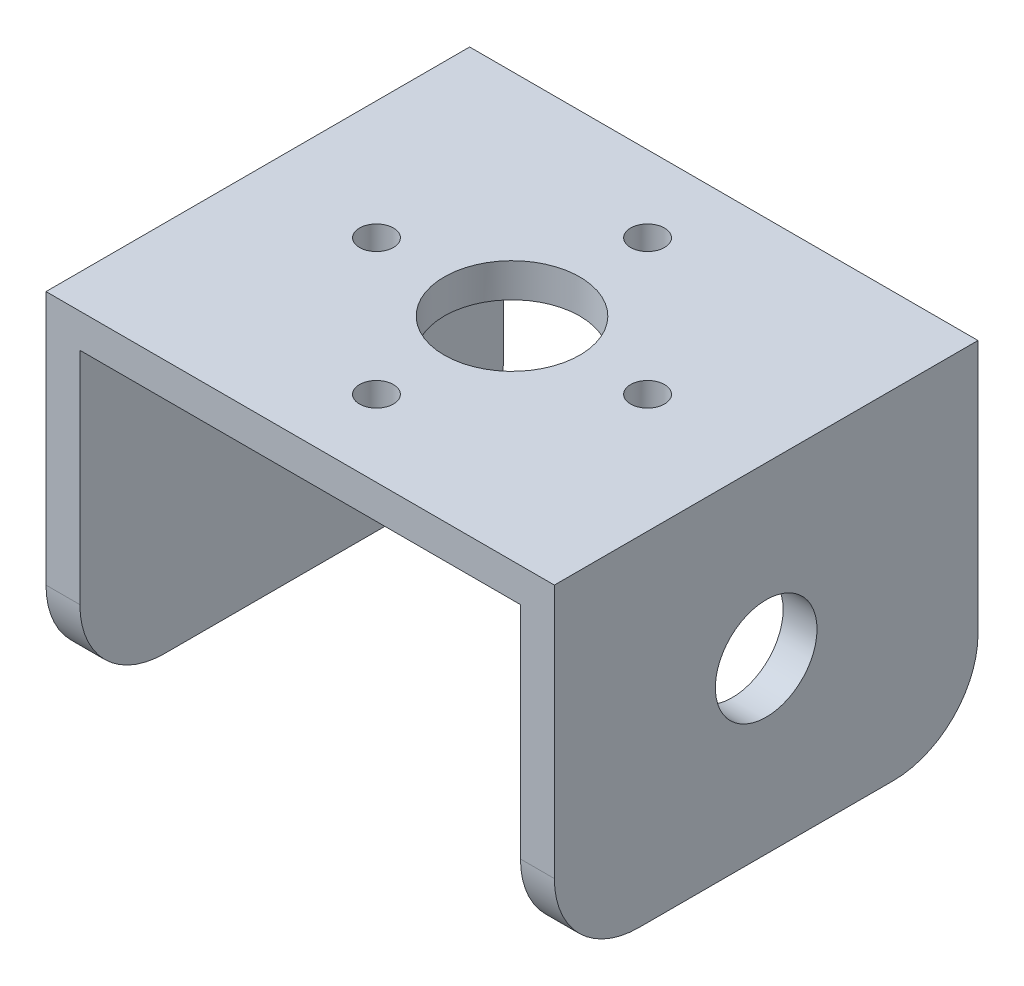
ISO-10303-21;
HEADER;
FILE_DESCRIPTION(('STEP AP214'),'2;1');
FILE_NAME('part.step','',(''),(''),'','','');
FILE_SCHEMA(('AUTOMOTIVE_DESIGN { 1 0 10303 214 1 1 1 1 }'));
ENDSEC;
DATA;
#1=APPLICATION_CONTEXT('core data for automotive mechanical design processes');
#2=APPLICATION_PROTOCOL_DEFINITION('international standard','automotive_design',2000,#1);
#3=PRODUCT_CONTEXT('',#1,'mechanical');
#4=PRODUCT('Part','Part','',(#3));
#5=PRODUCT_RELATED_PRODUCT_CATEGORY('part','',(#4));
#6=PRODUCT_DEFINITION_FORMATION('','',#4);
#7=PRODUCT_DEFINITION_CONTEXT('part definition',#1,'design');
#8=PRODUCT_DEFINITION('design','',#6,#7);
#9=PRODUCT_DEFINITION_SHAPE('','',#8);
#10=(LENGTH_UNIT() NAMED_UNIT(*) SI_UNIT(.MILLI.,.METRE.));
#11=(NAMED_UNIT(*) PLANE_ANGLE_UNIT() SI_UNIT($,.RADIAN.));
#12=(NAMED_UNIT(*) SI_UNIT($,.STERADIAN.) SOLID_ANGLE_UNIT());
#13=UNCERTAINTY_MEASURE_WITH_UNIT(LENGTH_MEASURE(1.E-05),#10,'distance_accuracy_value','');
#14=(GEOMETRIC_REPRESENTATION_CONTEXT(3) GLOBAL_UNCERTAINTY_ASSIGNED_CONTEXT((#13)) GLOBAL_UNIT_ASSIGNED_CONTEXT((#10,
#11,#12)) REPRESENTATION_CONTEXT('',''));
#15=CARTESIAN_POINT('',(0.,0.,0.));
#16=DIRECTION('',(0.,0.,1.));
#17=DIRECTION('',(1.,0.,0.));
#18=AXIS2_PLACEMENT_3D('',#15,#16,#17);
#19=CARTESIAN_POINT('',(-15.,-20.,12.5));
#20=DIRECTION('',(0.,0.,1.));
#21=DIRECTION('',(1.,0.,0.));
#22=AXIS2_PLACEMENT_3D('',#19,#20,#21);
#23=PLANE('',#22);
#24=DIRECTION('',(0.,1.,0.));
#25=VECTOR('',#24,1.);
#26=CARTESIAN_POINT('',(-15.,-20.,12.5));
#27=LINE('',#26,#25);
#28=CARTESIAN_POINT('',(-15.,-15.,12.5));
#29=VERTEX_POINT('',#28);
#30=CARTESIAN_POINT('',(-15.,0.,12.5));
#31=VERTEX_POINT('',#30);
#32=EDGE_CURVE('E194',#29,#31,#27,.T.);
#33=ORIENTED_EDGE('',*,*,#32,.F.);
#34=DIRECTION('',(1.,0.,0.));
#35=VECTOR('',#34,1.);
#36=CARTESIAN_POINT('',(-15.,-15.,12.5));
#37=LINE('',#36,#35);
#38=CARTESIAN_POINT('',(-13.,-15.,12.5));
#39=VERTEX_POINT('',#38);
#40=EDGE_CURVE('E11',#29,#39,#37,.T.);
#41=ORIENTED_EDGE('',*,*,#40,.T.);
#42=DIRECTION('',(0.,1.,0.));
#43=VECTOR('',#42,1.);
#44=CARTESIAN_POINT('',(-13.,-20.,12.5));
#45=LINE('',#44,#43);
#46=CARTESIAN_POINT('',(-13.,-2.,12.5));
#47=VERTEX_POINT('',#46);
#48=EDGE_CURVE('E144',#39,#47,#45,.T.);
#49=ORIENTED_EDGE('',*,*,#48,.T.);
#50=DIRECTION('',(1.,0.,0.));
#51=VECTOR('',#50,1.);
#52=CARTESIAN_POINT('',(-15.,-2.,12.5));
#53=LINE('',#52,#51);
#54=CARTESIAN_POINT('',(13.,-2.,12.5));
#55=VERTEX_POINT('',#54);
#56=EDGE_CURVE('E151',#47,#55,#53,.T.);
#57=ORIENTED_EDGE('',*,*,#56,.T.);
#58=DIRECTION('',(0.,1.,0.));
#59=VECTOR('',#58,1.);
#60=CARTESIAN_POINT('',(13.,-20.,12.5));
#61=LINE('',#60,#59);
#62=CARTESIAN_POINT('',(13.,-15.,12.5));
#63=VERTEX_POINT('',#62);
#64=EDGE_CURVE('E133',#63,#55,#61,.T.);
#65=ORIENTED_EDGE('',*,*,#64,.F.);
#66=DIRECTION('',(1.,0.,0.));
#67=VECTOR('',#66,1.);
#68=CARTESIAN_POINT('',(-15.,-15.,12.5));
#69=LINE('',#68,#67);
#70=CARTESIAN_POINT('',(15.,-15.,12.5));
#71=VERTEX_POINT('',#70);
#72=EDGE_CURVE('E49',#63,#71,#69,.T.);
#73=ORIENTED_EDGE('',*,*,#72,.T.);
#74=DIRECTION('',(0.,1.,0.));
#75=VECTOR('',#74,1.);
#76=CARTESIAN_POINT('',(15.,-20.,12.5));
#77=LINE('',#76,#75);
#78=CARTESIAN_POINT('',(15.,0.,12.5));
#79=VERTEX_POINT('',#78);
#80=EDGE_CURVE('E191',#71,#79,#77,.T.);
#81=ORIENTED_EDGE('',*,*,#80,.T.);
#82=DIRECTION('',(1.,0.,0.));
#83=VECTOR('',#82,1.);
#84=CARTESIAN_POINT('',(-15.,0.,12.5));
#85=LINE('',#84,#83);
#86=EDGE_CURVE('E177',#31,#79,#85,.T.);
#87=ORIENTED_EDGE('',*,*,#86,.F.);
#88=EDGE_LOOP('',(#33,#41,#49,#57,#65,#73,#81,#87));
#89=FACE_BOUND('',#88,.T.);
#90=ADVANCED_FACE('F41',(#89),#23,.T.);
#91=CARTESIAN_POINT('',(-15.,-20.,-12.5));
#92=DIRECTION('',(0.,0.,-1.));
#93=DIRECTION('',(-1.,0.,0.));
#94=AXIS2_PLACEMENT_3D('',#91,#92,#93);
#95=PLANE('',#94);
#96=DIRECTION('',(0.,1.,0.));
#97=VECTOR('',#96,1.);
#98=CARTESIAN_POINT('',(-13.,-20.,-12.5));
#99=LINE('',#98,#97);
#100=CARTESIAN_POINT('',(-13.,-15.,-12.5));
#101=VERTEX_POINT('',#100);
#102=CARTESIAN_POINT('',(-13.,-2.,-12.5));
#103=VERTEX_POINT('',#102);
#104=EDGE_CURVE('E167',#101,#103,#99,.T.);
#105=ORIENTED_EDGE('',*,*,#104,.F.);
#106=DIRECTION('',(-1.,0.,0.));
#107=VECTOR('',#106,1.);
#108=CARTESIAN_POINT('',(-15.,-15.,-12.5));
#109=LINE('',#108,#107);
#110=CARTESIAN_POINT('',(-15.,-15.,-12.5));
#111=VERTEX_POINT('',#110);
#112=EDGE_CURVE('E206',#101,#111,#109,.T.);
#113=ORIENTED_EDGE('',*,*,#112,.T.);
#114=DIRECTION('',(0.,1.,0.));
#115=VECTOR('',#114,1.);
#116=CARTESIAN_POINT('',(-15.,-20.,-12.5));
#117=LINE('',#116,#115);
#118=CARTESIAN_POINT('',(-15.,0.,-12.5));
#119=VERTEX_POINT('',#118);
#120=EDGE_CURVE('E196',#111,#119,#117,.T.);
#121=ORIENTED_EDGE('',*,*,#120,.T.);
#122=DIRECTION('',(-1.,0.,0.));
#123=VECTOR('',#122,1.);
#124=CARTESIAN_POINT('',(-15.,0.,-12.5));
#125=LINE('',#124,#123);
#126=CARTESIAN_POINT('',(15.,0.,-12.5));
#127=VERTEX_POINT('',#126);
#128=EDGE_CURVE('E183',#127,#119,#125,.T.);
#129=ORIENTED_EDGE('',*,*,#128,.F.);
#130=DIRECTION('',(0.,1.,0.));
#131=VECTOR('',#130,1.);
#132=CARTESIAN_POINT('',(15.,-20.,-12.5));
#133=LINE('',#132,#131);
#134=CARTESIAN_POINT('',(15.,-15.,-12.5));
#135=VERTEX_POINT('',#134);
#136=EDGE_CURVE('E180',#135,#127,#133,.T.);
#137=ORIENTED_EDGE('',*,*,#136,.F.);
#138=DIRECTION('',(-1.,0.,0.));
#139=VECTOR('',#138,1.);
#140=CARTESIAN_POINT('',(-15.,-15.,-12.5));
#141=LINE('',#140,#139);
#142=CARTESIAN_POINT('',(13.,-15.,-12.5));
#143=VERTEX_POINT('',#142);
#144=EDGE_CURVE('E193',#135,#143,#141,.T.);
#145=ORIENTED_EDGE('',*,*,#144,.T.);
#146=DIRECTION('',(0.,1.,0.));
#147=VECTOR('',#146,1.);
#148=CARTESIAN_POINT('',(13.,-20.,-12.5));
#149=LINE('',#148,#147);
#150=CARTESIAN_POINT('',(13.,-2.,-12.5));
#151=VERTEX_POINT('',#150);
#152=EDGE_CURVE('E170',#143,#151,#149,.T.);
#153=ORIENTED_EDGE('',*,*,#152,.T.);
#154=DIRECTION('',(-1.,0.,0.));
#155=VECTOR('',#154,1.);
#156=CARTESIAN_POINT('',(-15.,-2.,-12.5));
#157=LINE('',#156,#155);
#158=EDGE_CURVE('E153',#151,#103,#157,.T.);
#159=ORIENTED_EDGE('',*,*,#158,.T.);
#160=EDGE_LOOP('',(#105,#113,#121,#129,#137,#145,#153,#159));
#161=FACE_BOUND('',#160,.T.);
#162=ADVANCED_FACE('F258',(#161),#95,.T.);
#163=CARTESIAN_POINT('',(0.,-20.,0.));
#164=DIRECTION('',(0.,-1.,0.));
#165=DIRECTION('',(0.,0.,-1.));
#166=AXIS2_PLACEMENT_3D('',#163,#164,#165);
#167=PLANE('',#166);
#168=DIRECTION('',(0.,0.,-1.));
#169=VECTOR('',#168,1.);
#170=CARTESIAN_POINT('',(13.,-20.,12.5));
#171=LINE('',#170,#169);
#172=CARTESIAN_POINT('',(13.,-20.,7.5));
#173=VERTEX_POINT('',#172);
#174=CARTESIAN_POINT('',(13.,-20.,-7.5));
#175=VERTEX_POINT('',#174);
#176=EDGE_CURVE('E159',#173,#175,#171,.T.);
#177=ORIENTED_EDGE('',*,*,#176,.T.);
#178=DIRECTION('',(-1.,0.,0.));
#179=VECTOR('',#178,1.);
#180=CARTESIAN_POINT('',(0.,-20.,-7.5));
#181=LINE('',#180,#179);
#182=CARTESIAN_POINT('',(15.,-20.,-7.5));
#183=VERTEX_POINT('',#182);
#184=EDGE_CURVE('E64',#175,#183,#181,.F.);
#185=ORIENTED_EDGE('',*,*,#184,.T.);
#186=DIRECTION('',(0.,0.,-1.));
#187=VECTOR('',#186,1.);
#188=CARTESIAN_POINT('',(15.,-20.,12.5));
#189=LINE('',#188,#187);
#190=CARTESIAN_POINT('',(15.,-20.,7.5));
#191=VERTEX_POINT('',#190);
#192=EDGE_CURVE('E174',#191,#183,#189,.T.);
#193=ORIENTED_EDGE('',*,*,#192,.F.);
#194=DIRECTION('',(1.,0.,0.));
#195=VECTOR('',#194,1.);
#196=CARTESIAN_POINT('',(0.,-20.,7.5));
#197=LINE('',#196,#195);
#198=EDGE_CURVE('E224',#191,#173,#197,.F.);
#199=ORIENTED_EDGE('',*,*,#198,.T.);
#200=EDGE_LOOP('',(#177,#185,#193,#199));
#201=FACE_BOUND('',#200,.T.);
#202=ADVANCED_FACE('F262',(#201),#167,.T.);
#203=DIRECTION('',(0.,0.,1.));
#204=VECTOR('',#203,1.);
#205=CARTESIAN_POINT('',(-15.,-20.,12.5));
#206=LINE('',#205,#204);
#207=CARTESIAN_POINT('',(-15.,-20.,-7.5));
#208=VERTEX_POINT('',#207);
#209=CARTESIAN_POINT('',(-15.,-20.,7.5));
#210=VERTEX_POINT('',#209);
#211=EDGE_CURVE('E176',#208,#210,#206,.T.);
#212=ORIENTED_EDGE('',*,*,#211,.F.);
#213=DIRECTION('',(-1.,0.,0.));
#214=VECTOR('',#213,1.);
#215=CARTESIAN_POINT('',(0.,-20.,-7.5));
#216=LINE('',#215,#214);
#217=CARTESIAN_POINT('',(-13.,-20.,-7.5));
#218=VERTEX_POINT('',#217);
#219=EDGE_CURVE('E215',#208,#218,#216,.F.);
#220=ORIENTED_EDGE('',*,*,#219,.T.);
#221=DIRECTION('',(0.,0.,1.));
#222=VECTOR('',#221,1.);
#223=CARTESIAN_POINT('',(-13.,-20.,12.5));
#224=LINE('',#223,#222);
#225=CARTESIAN_POINT('',(-13.,-20.,7.5));
#226=VERTEX_POINT('',#225);
#227=EDGE_CURVE('E162',#218,#226,#224,.T.);
#228=ORIENTED_EDGE('',*,*,#227,.T.);
#229=DIRECTION('',(1.,0.,0.));
#230=VECTOR('',#229,1.);
#231=CARTESIAN_POINT('',(0.,-20.,7.5));
#232=LINE('',#231,#230);
#233=EDGE_CURVE('E213',#226,#210,#232,.F.);
#234=ORIENTED_EDGE('',*,*,#233,.T.);
#235=EDGE_LOOP('',(#212,#220,#228,#234));
#236=FACE_BOUND('',#235,.T.);
#237=ADVANCED_FACE('F251',(#236),#167,.T.);
#238=CARTESIAN_POINT('',(15.,-20.,12.5));
#239=DIRECTION('',(1.,0.,0.));
#240=DIRECTION('',(0.,0.,-1.));
#241=AXIS2_PLACEMENT_3D('',#238,#239,#240);
#242=PLANE('',#241);
#243=CARTESIAN_POINT('',(15.,-10.,0.));
#244=DIRECTION('',(1.,0.,0.));
#245=DIRECTION('',(0.,0.,-1.));
#246=AXIS2_PLACEMENT_3D('',#243,#244,#245);
#247=CIRCLE('',#246,3.);
#248=CARTESIAN_POINT('',(15.,-10.,-3.));
#249=VERTEX_POINT('',#248);
#250=EDGE_CURVE('E329',#249,#249,#247,.T.);
#251=ORIENTED_EDGE('',*,*,#250,.F.);
#252=EDGE_LOOP('',(#251));
#253=FACE_BOUND('',#252,.T.);
#254=ORIENTED_EDGE('',*,*,#192,.T.);
#255=CARTESIAN_POINT('',(15.,-15.,-7.5));
#256=DIRECTION('',(1.,0.,0.));
#257=DIRECTION('',(0.,0.,-1.));
#258=AXIS2_PLACEMENT_3D('',#255,#256,#257);
#259=CIRCLE('',#258,5.);
#260=EDGE_CURVE('E228',#183,#135,#259,.T.);
#261=ORIENTED_EDGE('',*,*,#260,.T.);
#262=ORIENTED_EDGE('',*,*,#136,.T.);
#263=DIRECTION('',(0.,0.,-1.));
#264=VECTOR('',#263,1.);
#265=CARTESIAN_POINT('',(15.,0.,12.5));
#266=LINE('',#265,#264);
#267=EDGE_CURVE('E143',#79,#127,#266,.T.);
#268=ORIENTED_EDGE('',*,*,#267,.F.);
#269=ORIENTED_EDGE('',*,*,#80,.F.);
#270=CARTESIAN_POINT('',(15.,-15.,7.5));
#271=DIRECTION('',(1.,0.,0.));
#272=DIRECTION('',(0.,0.,-1.));
#273=AXIS2_PLACEMENT_3D('',#270,#271,#272);
#274=CIRCLE('',#273,5.);
#275=EDGE_CURVE('E56',#71,#191,#274,.T.);
#276=ORIENTED_EDGE('',*,*,#275,.T.);
#277=EDGE_LOOP('',(#254,#261,#262,#268,#269,#276));
#278=FACE_BOUND('',#277,.T.);
#279=ADVANCED_FACE('F233',(#253,#278),#242,.T.);
#280=CARTESIAN_POINT('',(-15.,-20.,12.5));
#281=DIRECTION('',(-1.,0.,0.));
#282=DIRECTION('',(0.,0.,1.));
#283=AXIS2_PLACEMENT_3D('',#280,#281,#282);
#284=PLANE('',#283);
#285=CARTESIAN_POINT('',(-15.,-10.,0.));
#286=DIRECTION('',(1.,0.,0.));
#287=DIRECTION('',(0.,0.,-1.));
#288=AXIS2_PLACEMENT_3D('',#285,#286,#287);
#289=CIRCLE('',#288,3.);
#290=CARTESIAN_POINT('',(-15.,-10.,-3.));
#291=VERTEX_POINT('',#290);
#292=EDGE_CURVE('E203',#291,#291,#289,.T.);
#293=ORIENTED_EDGE('',*,*,#292,.T.);
#294=EDGE_LOOP('',(#293));
#295=FACE_BOUND('',#294,.T.);
#296=ORIENTED_EDGE('',*,*,#120,.F.);
#297=CARTESIAN_POINT('',(-15.,-15.,-7.5));
#298=DIRECTION('',(-1.,0.,0.));
#299=DIRECTION('',(0.,0.,1.));
#300=AXIS2_PLACEMENT_3D('',#297,#298,#299);
#301=CIRCLE('',#300,5.);
#302=EDGE_CURVE('E211',#111,#208,#301,.T.);
#303=ORIENTED_EDGE('',*,*,#302,.T.);
#304=ORIENTED_EDGE('',*,*,#211,.T.);
#305=CARTESIAN_POINT('',(-15.,-15.,7.5));
#306=DIRECTION('',(-1.,0.,0.));
#307=DIRECTION('',(0.,0.,1.));
#308=AXIS2_PLACEMENT_3D('',#305,#306,#307);
#309=CIRCLE('',#308,5.);
#310=EDGE_CURVE('E209',#210,#29,#309,.T.);
#311=ORIENTED_EDGE('',*,*,#310,.T.);
#312=ORIENTED_EDGE('',*,*,#32,.T.);
#313=DIRECTION('',(0.,0.,1.));
#314=VECTOR('',#313,1.);
#315=CARTESIAN_POINT('',(-15.,0.,12.5));
#316=LINE('',#315,#314);
#317=EDGE_CURVE('E186',#119,#31,#316,.T.);
#318=ORIENTED_EDGE('',*,*,#317,.F.);
#319=EDGE_LOOP('',(#296,#303,#304,#311,#312,#318));
#320=FACE_BOUND('',#319,.T.);
#321=ADVANCED_FACE('F265',(#295,#320),#284,.T.);
#322=CARTESIAN_POINT('',(0.,0.,0.));
#323=DIRECTION('',(0.,-1.,0.));
#324=DIRECTION('',(0.,0.,-1.));
#325=AXIS2_PLACEMENT_3D('',#322,#323,#324);
#326=PLANE('',#325);
#327=CARTESIAN_POINT('',(0.,0.,-8.));
#328=DIRECTION('',(0.,1.,0.));
#329=DIRECTION('',(0.,0.,1.));
#330=AXIS2_PLACEMENT_3D('',#327,#328,#329);
#331=CIRCLE('',#330,1.);
#332=CARTESIAN_POINT('',(0.,0.,-7.));
#333=VERTEX_POINT('',#332);
#334=EDGE_CURVE('E353',#333,#333,#331,.T.);
#335=ORIENTED_EDGE('',*,*,#334,.F.);
#336=EDGE_LOOP('',(#335));
#337=FACE_BOUND('',#336,.T.);
#338=CARTESIAN_POINT('',(8.,0.,0.));
#339=DIRECTION('',(0.,1.,0.));
#340=DIRECTION('',(0.,0.,1.));
#341=AXIS2_PLACEMENT_3D('',#338,#339,#340);
#342=CIRCLE('',#341,1.);
#343=CARTESIAN_POINT('',(8.,0.,1.00000000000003));
#344=VERTEX_POINT('',#343);
#345=EDGE_CURVE('E343',#344,#344,#342,.T.);
#346=ORIENTED_EDGE('',*,*,#345,.F.);
#347=EDGE_LOOP('',(#346));
#348=FACE_BOUND('',#347,.T.);
#349=CARTESIAN_POINT('',(0.,0.,8.));
#350=DIRECTION('',(0.,1.,0.));
#351=DIRECTION('',(0.,0.,1.));
#352=AXIS2_PLACEMENT_3D('',#349,#350,#351);
#353=CIRCLE('',#352,1.);
#354=CARTESIAN_POINT('',(0.,0.,9.));
#355=VERTEX_POINT('',#354);
#356=EDGE_CURVE('E344',#355,#355,#353,.T.);
#357=ORIENTED_EDGE('',*,*,#356,.F.);
#358=EDGE_LOOP('',(#357));
#359=FACE_BOUND('',#358,.T.);
#360=CARTESIAN_POINT('',(-8.,0.,0.));
#361=DIRECTION('',(0.,1.,0.));
#362=DIRECTION('',(0.,0.,1.));
#363=AXIS2_PLACEMENT_3D('',#360,#361,#362);
#364=CIRCLE('',#363,1.);
#365=CARTESIAN_POINT('',(-8.,0.,0.999999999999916));
#366=VERTEX_POINT('',#365);
#367=EDGE_CURVE('E332',#366,#366,#364,.T.);
#368=ORIENTED_EDGE('',*,*,#367,.F.);
#369=EDGE_LOOP('',(#368));
#370=FACE_BOUND('',#369,.T.);
#371=CARTESIAN_POINT('',(0.,0.,0.));
#372=DIRECTION('',(0.,1.,0.));
#373=DIRECTION('',(0.,0.,1.));
#374=AXIS2_PLACEMENT_3D('',#371,#372,#373);
#375=CIRCLE('',#374,4.);
#376=CARTESIAN_POINT('',(0.,0.,4.));
#377=VERTEX_POINT('',#376);
#378=EDGE_CURVE('E154',#377,#377,#375,.T.);
#379=ORIENTED_EDGE('',*,*,#378,.F.);
#380=EDGE_LOOP('',(#379));
#381=FACE_BOUND('',#380,.T.);
#382=ORIENTED_EDGE('',*,*,#267,.T.);
#383=ORIENTED_EDGE('',*,*,#128,.T.);
#384=ORIENTED_EDGE('',*,*,#317,.T.);
#385=ORIENTED_EDGE('',*,*,#86,.T.);
#386=EDGE_LOOP('',(#382,#383,#384,#385));
#387=FACE_BOUND('',#386,.T.);
#388=ADVANCED_FACE('F237',(#337,#348,#359,#370,#381,#387),#326,.F.);
#389=CARTESIAN_POINT('',(13.,-20.,12.5));
#390=DIRECTION('',(1.,0.,0.));
#391=DIRECTION('',(0.,0.,-1.));
#392=AXIS2_PLACEMENT_3D('',#389,#390,#391);
#393=PLANE('',#392);
#394=CARTESIAN_POINT('',(13.,-10.,0.));
#395=DIRECTION('',(1.,0.,0.));
#396=DIRECTION('',(0.,0.,-1.));
#397=AXIS2_PLACEMENT_3D('',#394,#395,#396);
#398=CIRCLE('',#397,3.);
#399=CARTESIAN_POINT('',(13.,-10.,-3.));
#400=VERTEX_POINT('',#399);
#401=EDGE_CURVE('E202',#400,#400,#398,.T.);
#402=ORIENTED_EDGE('',*,*,#401,.T.);
#403=EDGE_LOOP('',(#402));
#404=FACE_BOUND('',#403,.T.);
#405=ORIENTED_EDGE('',*,*,#152,.F.);
#406=CARTESIAN_POINT('',(13.,-15.,-7.5));
#407=DIRECTION('',(1.,0.,0.));
#408=DIRECTION('',(0.,0.,-1.));
#409=AXIS2_PLACEMENT_3D('',#406,#407,#408);
#410=CIRCLE('',#409,5.);
#411=EDGE_CURVE('E222',#143,#175,#410,.F.);
#412=ORIENTED_EDGE('',*,*,#411,.T.);
#413=ORIENTED_EDGE('',*,*,#176,.F.);
#414=CARTESIAN_POINT('',(13.,-15.,7.5));
#415=DIRECTION('',(1.,0.,0.));
#416=DIRECTION('',(0.,0.,-1.));
#417=AXIS2_PLACEMENT_3D('',#414,#415,#416);
#418=CIRCLE('',#417,5.);
#419=EDGE_CURVE('E140',#173,#63,#418,.F.);
#420=ORIENTED_EDGE('',*,*,#419,.T.);
#421=ORIENTED_EDGE('',*,*,#64,.T.);
#422=DIRECTION('',(0.,0.,-1.));
#423=VECTOR('',#422,1.);
#424=CARTESIAN_POINT('',(13.,-2.,12.5));
#425=LINE('',#424,#423);
#426=EDGE_CURVE('E137',#55,#151,#425,.T.);
#427=ORIENTED_EDGE('',*,*,#426,.T.);
#428=EDGE_LOOP('',(#405,#412,#413,#420,#421,#427));
#429=FACE_BOUND('',#428,.T.);
#430=ADVANCED_FACE('F136',(#404,#429),#393,.F.);
#431=CARTESIAN_POINT('',(-13.,-20.,12.5));
#432=DIRECTION('',(-1.,0.,0.));
#433=DIRECTION('',(0.,0.,1.));
#434=AXIS2_PLACEMENT_3D('',#431,#432,#433);
#435=PLANE('',#434);
#436=CARTESIAN_POINT('',(-13.,-10.,0.));
#437=DIRECTION('',(-1.,0.,0.));
#438=DIRECTION('',(0.,0.,1.));
#439=AXIS2_PLACEMENT_3D('',#436,#437,#438);
#440=CIRCLE('',#439,3.);
#441=CARTESIAN_POINT('',(-13.,-10.,3.));
#442=VERTEX_POINT('',#441);
#443=EDGE_CURVE('E199',#442,#442,#440,.T.);
#444=ORIENTED_EDGE('',*,*,#443,.T.);
#445=EDGE_LOOP('',(#444));
#446=FACE_BOUND('',#445,.T.);
#447=ORIENTED_EDGE('',*,*,#227,.F.);
#448=CARTESIAN_POINT('',(-13.,-15.,-7.5));
#449=DIRECTION('',(-1.,0.,0.));
#450=DIRECTION('',(0.,0.,1.));
#451=AXIS2_PLACEMENT_3D('',#448,#449,#450);
#452=CIRCLE('',#451,5.);
#453=EDGE_CURVE('E219',#218,#101,#452,.F.);
#454=ORIENTED_EDGE('',*,*,#453,.T.);
#455=ORIENTED_EDGE('',*,*,#104,.T.);
#456=DIRECTION('',(0.,0.,1.));
#457=VECTOR('',#456,1.);
#458=CARTESIAN_POINT('',(-13.,-2.,12.5));
#459=LINE('',#458,#457);
#460=EDGE_CURVE('E160',#103,#47,#459,.T.);
#461=ORIENTED_EDGE('',*,*,#460,.T.);
#462=ORIENTED_EDGE('',*,*,#48,.F.);
#463=CARTESIAN_POINT('',(-13.,-15.,7.5));
#464=DIRECTION('',(-1.,0.,0.));
#465=DIRECTION('',(0.,0.,1.));
#466=AXIS2_PLACEMENT_3D('',#463,#464,#465);
#467=CIRCLE('',#466,5.);
#468=EDGE_CURVE('E217',#39,#226,#467,.F.);
#469=ORIENTED_EDGE('',*,*,#468,.T.);
#470=EDGE_LOOP('',(#447,#454,#455,#461,#462,#469));
#471=FACE_BOUND('',#470,.T.);
#472=ADVANCED_FACE('F247',(#446,#471),#435,.F.);
#473=CARTESIAN_POINT('',(0.,-2.,0.));
#474=DIRECTION('',(0.,-1.,0.));
#475=DIRECTION('',(0.,0.,-1.));
#476=AXIS2_PLACEMENT_3D('',#473,#474,#475);
#477=PLANE('',#476);
#478=CARTESIAN_POINT('',(0.,-2.,-8.));
#479=DIRECTION('',(0.,-1.,0.));
#480=DIRECTION('',(0.,0.,-1.));
#481=AXIS2_PLACEMENT_3D('',#478,#479,#480);
#482=CIRCLE('',#481,1.);
#483=CARTESIAN_POINT('',(0.,-2.,-9.));
#484=VERTEX_POINT('',#483);
#485=EDGE_CURVE('E349',#484,#484,#482,.F.);
#486=ORIENTED_EDGE('',*,*,#485,.T.);
#487=EDGE_LOOP('',(#486));
#488=FACE_BOUND('',#487,.T.);
#489=CARTESIAN_POINT('',(8.,-2.,0.));
#490=DIRECTION('',(0.,-1.,0.));
#491=DIRECTION('',(0.,0.,-1.));
#492=AXIS2_PLACEMENT_3D('',#489,#490,#491);
#493=CIRCLE('',#492,1.);
#494=CARTESIAN_POINT('',(8.,-2.,-0.999999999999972));
#495=VERTEX_POINT('',#494);
#496=EDGE_CURVE('E356',#495,#495,#493,.F.);
#497=ORIENTED_EDGE('',*,*,#496,.T.);
#498=EDGE_LOOP('',(#497));
#499=FACE_BOUND('',#498,.T.);
#500=CARTESIAN_POINT('',(0.,-2.,8.));
#501=DIRECTION('',(0.,-1.,0.));
#502=DIRECTION('',(0.,0.,-1.));
#503=AXIS2_PLACEMENT_3D('',#500,#501,#502);
#504=CIRCLE('',#503,1.);
#505=CARTESIAN_POINT('',(0.,-2.,7.));
#506=VERTEX_POINT('',#505);
#507=EDGE_CURVE('E340',#506,#506,#504,.F.);
#508=ORIENTED_EDGE('',*,*,#507,.T.);
#509=EDGE_LOOP('',(#508));
#510=FACE_BOUND('',#509,.T.);
#511=CARTESIAN_POINT('',(-8.,-2.,0.));
#512=DIRECTION('',(0.,-1.,0.));
#513=DIRECTION('',(0.,0.,-1.));
#514=AXIS2_PLACEMENT_3D('',#511,#512,#513);
#515=CIRCLE('',#514,1.);
#516=CARTESIAN_POINT('',(-8.,-2.,-1.00000000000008));
#517=VERTEX_POINT('',#516);
#518=EDGE_CURVE('E335',#517,#517,#515,.F.);
#519=ORIENTED_EDGE('',*,*,#518,.T.);
#520=EDGE_LOOP('',(#519));
#521=FACE_BOUND('',#520,.T.);
#522=CARTESIAN_POINT('',(0.,-2.,0.));
#523=DIRECTION('',(0.,-1.,0.));
#524=DIRECTION('',(0.,0.,-1.));
#525=AXIS2_PLACEMENT_3D('',#522,#523,#524);
#526=CIRCLE('',#525,4.);
#527=CARTESIAN_POINT('',(0.,-2.,-4.));
#528=VERTEX_POINT('',#527);
#529=EDGE_CURVE('E352',#528,#528,#526,.F.);
#530=ORIENTED_EDGE('',*,*,#529,.T.);
#531=EDGE_LOOP('',(#530));
#532=FACE_BOUND('',#531,.T.);
#533=ORIENTED_EDGE('',*,*,#426,.F.);
#534=ORIENTED_EDGE('',*,*,#56,.F.);
#535=ORIENTED_EDGE('',*,*,#460,.F.);
#536=ORIENTED_EDGE('',*,*,#158,.F.);
#537=EDGE_LOOP('',(#533,#534,#535,#536));
#538=FACE_BOUND('',#537,.T.);
#539=ADVANCED_FACE('F149',(#488,#499,#510,#521,#532,#538),#477,.T.);
#540=CARTESIAN_POINT('',(0.,-20.001,0.));
#541=DIRECTION('',(0.,1.,0.));
#542=DIRECTION('',(0.,0.,1.));
#543=AXIS2_PLACEMENT_3D('',#540,#541,#542);
#544=CYLINDRICAL_SURFACE('',#543,4.);
#545=ORIENTED_EDGE('',*,*,#529,.F.);
#546=EDGE_LOOP('',(#545));
#547=FACE_BOUND('',#546,.T.);
#548=ORIENTED_EDGE('',*,*,#378,.T.);
#549=EDGE_LOOP('',(#548));
#550=FACE_BOUND('',#549,.T.);
#551=ADVANCED_FACE('F289',(#547,#550),#544,.F.);
#552=CARTESIAN_POINT('',(-8.,-20.001,0.));
#553=DIRECTION('',(0.,1.,0.));
#554=DIRECTION('',(0.,0.,1.));
#555=AXIS2_PLACEMENT_3D('',#552,#553,#554);
#556=CYLINDRICAL_SURFACE('',#555,1.);
#557=ORIENTED_EDGE('',*,*,#518,.F.);
#558=EDGE_LOOP('',(#557));
#559=FACE_BOUND('',#558,.T.);
#560=ORIENTED_EDGE('',*,*,#367,.T.);
#561=EDGE_LOOP('',(#560));
#562=FACE_BOUND('',#561,.T.);
#563=ADVANCED_FACE('F299',(#559,#562),#556,.F.);
#564=CARTESIAN_POINT('',(0.,-20.001,8.));
#565=DIRECTION('',(0.,1.,0.));
#566=DIRECTION('',(0.,0.,1.));
#567=AXIS2_PLACEMENT_3D('',#564,#565,#566);
#568=CYLINDRICAL_SURFACE('',#567,1.);
#569=ORIENTED_EDGE('',*,*,#507,.F.);
#570=EDGE_LOOP('',(#569));
#571=FACE_BOUND('',#570,.T.);
#572=ORIENTED_EDGE('',*,*,#356,.T.);
#573=EDGE_LOOP('',(#572));
#574=FACE_BOUND('',#573,.T.);
#575=ADVANCED_FACE('F305',(#571,#574),#568,.F.);
#576=CARTESIAN_POINT('',(8.,-20.001,0.));
#577=DIRECTION('',(0.,1.,0.));
#578=DIRECTION('',(0.,0.,1.));
#579=AXIS2_PLACEMENT_3D('',#576,#577,#578);
#580=CYLINDRICAL_SURFACE('',#579,1.);
#581=ORIENTED_EDGE('',*,*,#496,.F.);
#582=EDGE_LOOP('',(#581));
#583=FACE_BOUND('',#582,.T.);
#584=ORIENTED_EDGE('',*,*,#345,.T.);
#585=EDGE_LOOP('',(#584));
#586=FACE_BOUND('',#585,.T.);
#587=ADVANCED_FACE('F301',(#583,#586),#580,.F.);
#588=CARTESIAN_POINT('',(0.,-20.001,-8.));
#589=DIRECTION('',(0.,1.,0.));
#590=DIRECTION('',(0.,0.,1.));
#591=AXIS2_PLACEMENT_3D('',#588,#589,#590);
#592=CYLINDRICAL_SURFACE('',#591,1.);
#593=ORIENTED_EDGE('',*,*,#485,.F.);
#594=EDGE_LOOP('',(#593));
#595=FACE_BOUND('',#594,.T.);
#596=ORIENTED_EDGE('',*,*,#334,.T.);
#597=EDGE_LOOP('',(#596));
#598=FACE_BOUND('',#597,.T.);
#599=ADVANCED_FACE('F304',(#595,#598),#592,.F.);
#600=CARTESIAN_POINT('',(-15.,-10.,0.));
#601=DIRECTION('',(1.,0.,0.));
#602=DIRECTION('',(0.,0.,-1.));
#603=AXIS2_PLACEMENT_3D('',#600,#601,#602);
#604=CYLINDRICAL_SURFACE('',#603,3.);
#605=ORIENTED_EDGE('',*,*,#292,.F.);
#606=EDGE_LOOP('',(#605));
#607=FACE_BOUND('',#606,.T.);
#608=ORIENTED_EDGE('',*,*,#443,.F.);
#609=EDGE_LOOP('',(#608));
#610=FACE_BOUND('',#609,.T.);
#611=ADVANCED_FACE('F309',(#607,#610),#604,.F.);
#612=ORIENTED_EDGE('',*,*,#250,.T.);
#613=EDGE_LOOP('',(#612));
#614=FACE_BOUND('',#613,.T.);
#615=ORIENTED_EDGE('',*,*,#401,.F.);
#616=EDGE_LOOP('',(#615));
#617=FACE_BOUND('',#616,.T.);
#618=ADVANCED_FACE('F317',(#614,#617),#604,.F.);
#619=CARTESIAN_POINT('',(-15.,-15.,-7.5));
#620=DIRECTION('',(-1.,0.,0.));
#621=DIRECTION('',(0.,0.,1.));
#622=AXIS2_PLACEMENT_3D('',#619,#620,#621);
#623=CYLINDRICAL_SURFACE('',#622,5.);
#624=ORIENTED_EDGE('',*,*,#453,.F.);
#625=ORIENTED_EDGE('',*,*,#219,.F.);
#626=ORIENTED_EDGE('',*,*,#302,.F.);
#627=ORIENTED_EDGE('',*,*,#112,.F.);
#628=EDGE_LOOP('',(#624,#625,#626,#627));
#629=FACE_BOUND('',#628,.T.);
#630=ADVANCED_FACE('F254',(#629),#623,.T.);
#631=CARTESIAN_POINT('',(-15.,-15.,-7.5));
#632=DIRECTION('',(-1.,0.,0.));
#633=DIRECTION('',(0.,0.,1.));
#634=AXIS2_PLACEMENT_3D('',#631,#632,#633);
#635=CYLINDRICAL_SURFACE('',#634,5.);
#636=ORIENTED_EDGE('',*,*,#260,.F.);
#637=ORIENTED_EDGE('',*,*,#184,.F.);
#638=ORIENTED_EDGE('',*,*,#411,.F.);
#639=ORIENTED_EDGE('',*,*,#144,.F.);
#640=EDGE_LOOP('',(#636,#637,#638,#639));
#641=FACE_BOUND('',#640,.T.);
#642=ADVANCED_FACE('F264',(#641),#635,.T.);
#643=CARTESIAN_POINT('',(-15.,-15.,7.5));
#644=DIRECTION('',(1.,0.,0.));
#645=DIRECTION('',(0.,0.,-1.));
#646=AXIS2_PLACEMENT_3D('',#643,#644,#645);
#647=CYLINDRICAL_SURFACE('',#646,5.);
#648=ORIENTED_EDGE('',*,*,#310,.F.);
#649=ORIENTED_EDGE('',*,*,#233,.F.);
#650=ORIENTED_EDGE('',*,*,#468,.F.);
#651=ORIENTED_EDGE('',*,*,#40,.F.);
#652=EDGE_LOOP('',(#648,#649,#650,#651));
#653=FACE_BOUND('',#652,.T.);
#654=ADVANCED_FACE('F243',(#653),#647,.T.);
#655=CARTESIAN_POINT('',(-15.,-15.,7.5));
#656=DIRECTION('',(1.,0.,0.));
#657=DIRECTION('',(0.,0.,-1.));
#658=AXIS2_PLACEMENT_3D('',#655,#656,#657);
#659=CYLINDRICAL_SURFACE('',#658,5.);
#660=ORIENTED_EDGE('',*,*,#419,.F.);
#661=ORIENTED_EDGE('',*,*,#198,.F.);
#662=ORIENTED_EDGE('',*,*,#275,.F.);
#663=ORIENTED_EDGE('',*,*,#72,.F.);
#664=EDGE_LOOP('',(#660,#661,#662,#663));
#665=FACE_BOUND('',#664,.T.);
#666=ADVANCED_FACE('F43',(#665),#659,.T.);
#667=CLOSED_SHELL('',(#90,#162,#202,#237,#279,#321,#388,#430,#472,#539,#551,#563,#575,#587,#599,
#611,#618,#630,#642,#654,#666));
#668=MANIFOLD_SOLID_BREP('B2',#667);
#669=ADVANCED_BREP_SHAPE_REPRESENTATION('',(#18,#668),#14);
#670=SHAPE_DEFINITION_REPRESENTATION(#9,#669);
ENDSEC;
END-ISO-10303-21;
